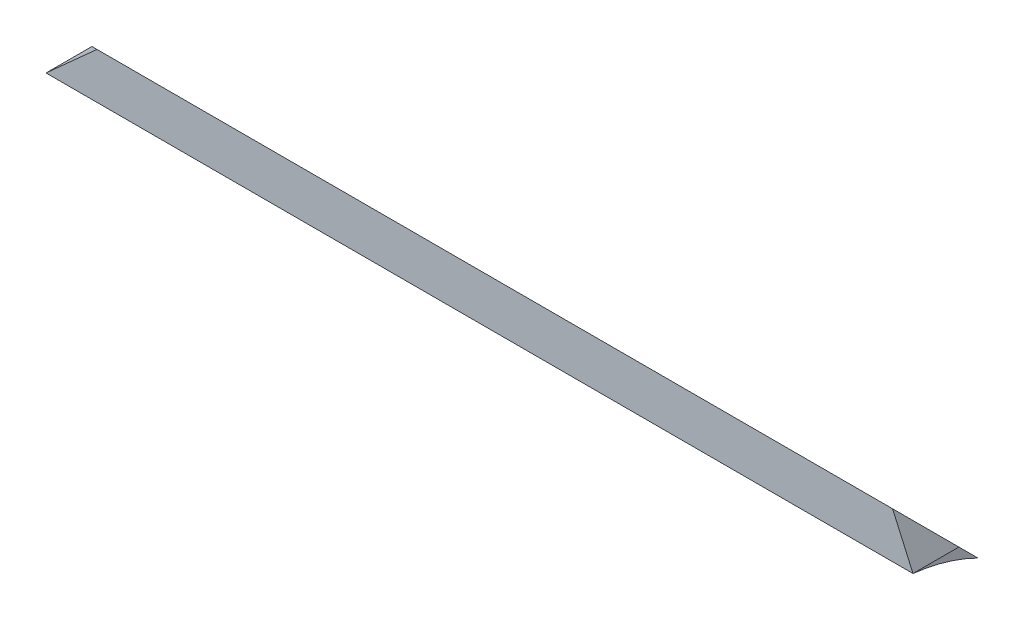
ISO-10303-21;
HEADER;
FILE_DESCRIPTION(('STEP AP214'),'2;1');
FILE_NAME('part.step','',(''),(''),'','','');
FILE_SCHEMA(('AUTOMOTIVE_DESIGN { 1 0 10303 214 1 1 1 1 }'));
ENDSEC;
DATA;
#1=APPLICATION_CONTEXT('core data for automotive mechanical design processes');
#2=APPLICATION_PROTOCOL_DEFINITION('international standard','automotive_design',2000,#1);
#3=PRODUCT_CONTEXT('',#1,'mechanical');
#4=PRODUCT('Part','Part','',(#3));
#5=PRODUCT_RELATED_PRODUCT_CATEGORY('part','',(#4));
#6=PRODUCT_DEFINITION_FORMATION('','',#4);
#7=PRODUCT_DEFINITION_CONTEXT('part definition',#1,'design');
#8=PRODUCT_DEFINITION('design','',#6,#7);
#9=PRODUCT_DEFINITION_SHAPE('','',#8);
#10=(LENGTH_UNIT() NAMED_UNIT(*) SI_UNIT(.MILLI.,.METRE.));
#11=(NAMED_UNIT(*) PLANE_ANGLE_UNIT() SI_UNIT($,.RADIAN.));
#12=(NAMED_UNIT(*) SI_UNIT($,.STERADIAN.) SOLID_ANGLE_UNIT());
#13=UNCERTAINTY_MEASURE_WITH_UNIT(LENGTH_MEASURE(1.E-05),#10,'distance_accuracy_value','');
#14=(GEOMETRIC_REPRESENTATION_CONTEXT(3) GLOBAL_UNCERTAINTY_ASSIGNED_CONTEXT((#13)) GLOBAL_UNIT_ASSIGNED_CONTEXT((#10,
#11,#12)) REPRESENTATION_CONTEXT('',''));
#15=CARTESIAN_POINT('',(0.,0.,0.));
#16=DIRECTION('',(0.,0.,1.));
#17=DIRECTION('',(1.,0.,0.));
#18=AXIS2_PLACEMENT_3D('',#15,#16,#17);
#19=CARTESIAN_POINT('',(0.,12.7,0.));
#20=DIRECTION('',(1.,0.,0.));
#21=DIRECTION('',(0.,0.,-1.));
#22=AXIS2_PLACEMENT_3D('',#19,#20,#21);
#23=PLANE('',#22);
#24=DIRECTION('',(0.,0.,1.));
#25=VECTOR('',#24,1.);
#26=CARTESIAN_POINT('',(0.,2.80039496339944,-12.7));
#27=LINE('',#26,#25);
#28=CARTESIAN_POINT('',(0.,2.80039496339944,-9.89960503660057));
#29=VERTEX_POINT('',#28);
#30=CARTESIAN_POINT('',(0.,2.80039496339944,-3.175));
#31=VERTEX_POINT('',#30);
#32=EDGE_CURVE('E77',#29,#31,#27,.T.);
#33=ORIENTED_EDGE('',*,*,#32,.F.);
#34=DIRECTION('',(0.,-0.707106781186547,-0.707106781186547));
#35=VECTOR('',#34,1.);
#36=CARTESIAN_POINT('',(0.,12.7,0.));
#37=LINE('',#36,#35);
#38=CARTESIAN_POINT('',(0.,0.,-12.7));
#39=VERTEX_POINT('',#38);
#40=EDGE_CURVE('E54',#29,#39,#37,.T.);
#41=ORIENTED_EDGE('',*,*,#40,.T.);
#42=CARTESIAN_POINT('',(0.,-25.5976683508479,0.));
#43=DIRECTION('',(1.,0.,0.));
#44=DIRECTION('',(0.,0.,-1.));
#45=AXIS2_PLACEMENT_3D('',#42,#43,#44);
#46=CIRCLE('',#45,28.575);
#47=EDGE_CURVE('E97',#39,#31,#46,.T.);
#48=ORIENTED_EDGE('',*,*,#47,.T.);
#49=EDGE_LOOP('',(#33,#41,#48));
#50=FACE_BOUND('',#49,.T.);
#51=ADVANCED_FACE('F32',(#50),#23,.F.);
#52=CARTESIAN_POINT('',(127.,12.7,0.));
#53=DIRECTION('',(-1.,0.,0.));
#54=DIRECTION('',(0.,0.,1.));
#55=AXIS2_PLACEMENT_3D('',#52,#53,#54);
#56=PLANE('',#55);
#57=DIRECTION('',(0.,0.,1.));
#58=VECTOR('',#57,1.);
#59=CARTESIAN_POINT('',(127.,2.80039496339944,-12.7));
#60=LINE('',#59,#58);
#61=CARTESIAN_POINT('',(127.,2.80039496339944,-9.89960503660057));
#62=VERTEX_POINT('',#61);
#63=CARTESIAN_POINT('',(127.,2.80039496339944,-3.175));
#64=VERTEX_POINT('',#63);
#65=EDGE_CURVE('E71',#62,#64,#60,.T.);
#66=ORIENTED_EDGE('',*,*,#65,.T.);
#67=CARTESIAN_POINT('',(127.,-25.5976683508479,0.));
#68=DIRECTION('',(1.,0.,0.));
#69=DIRECTION('',(0.,0.,-1.));
#70=AXIS2_PLACEMENT_3D('',#67,#68,#69);
#71=CIRCLE('',#70,28.575);
#72=CARTESIAN_POINT('',(127.,0.,-12.7));
#73=VERTEX_POINT('',#72);
#74=EDGE_CURVE('E91',#73,#64,#71,.T.);
#75=ORIENTED_EDGE('',*,*,#74,.F.);
#76=DIRECTION('',(0.,-0.707106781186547,-0.707106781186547));
#77=VECTOR('',#76,1.);
#78=CARTESIAN_POINT('',(127.,12.7,0.));
#79=LINE('',#78,#77);
#80=EDGE_CURVE('E84',#62,#73,#79,.T.);
#81=ORIENTED_EDGE('',*,*,#80,.F.);
#82=EDGE_LOOP('',(#66,#75,#81));
#83=FACE_BOUND('',#82,.T.);
#84=ADVANCED_FACE('F90',(#83),#56,.F.);
#85=CARTESIAN_POINT('',(0.,12.7,0.));
#86=DIRECTION('',(0.,-0.707106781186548,0.707106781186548));
#87=DIRECTION('',(0.,-0.707106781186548,-0.707106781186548));
#88=AXIS2_PLACEMENT_3D('',#85,#86,#87);
#89=PLANE('',#88);
#90=DIRECTION('',(-0.617802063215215,-0.556021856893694,-0.556021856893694));
#91=VECTOR('',#90,1.);
#92=CARTESIAN_POINT('',(6.80125536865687,8.92152479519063,-3.77847520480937));
#93=LINE('',#92,#91);
#94=CARTESIAN_POINT('',(7.47178337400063,9.525,-3.175));
#95=VERTEX_POINT('',#94);
#96=EDGE_CURVE('E88',#95,#29,#93,.T.);
#97=ORIENTED_EDGE('',*,*,#96,.F.);
#98=DIRECTION('',(1.,0.,0.));
#99=VECTOR('',#98,1.);
#100=CARTESIAN_POINT('',(0.,9.525,-3.175));
#101=LINE('',#100,#99);
#102=CARTESIAN_POINT('',(124.0112866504,9.525,-3.175));
#103=VERTEX_POINT('',#102);
#104=EDGE_CURVE('E87',#95,#103,#101,.T.);
#105=ORIENTED_EDGE('',*,*,#104,.T.);
#106=DIRECTION('',(-0.299812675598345,0.674578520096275,0.674578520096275));
#107=VECTOR('',#106,1.);
#108=CARTESIAN_POINT('',(111.579935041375,37.4955411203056,24.7955411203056));
#109=LINE('',#108,#107);
#110=EDGE_CURVE('E46',#62,#103,#109,.T.);
#111=ORIENTED_EDGE('',*,*,#110,.F.);
#112=ORIENTED_EDGE('',*,*,#80,.T.);
#113=DIRECTION('',(-1.,0.,0.));
#114=VECTOR('',#113,1.);
#115=CARTESIAN_POINT('',(0.,0.,-12.7));
#116=LINE('',#115,#114);
#117=EDGE_CURVE('E94',#73,#39,#116,.T.);
#118=ORIENTED_EDGE('',*,*,#117,.T.);
#119=ORIENTED_EDGE('',*,*,#40,.F.);
#120=EDGE_LOOP('',(#97,#105,#111,#112,#118,#119));
#121=FACE_BOUND('',#120,.T.);
#122=ADVANCED_FACE('F82',(#121),#89,.F.);
#123=CARTESIAN_POINT('',(0.,22.1081044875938,-3.175));
#124=DIRECTION('',(0.,0.,-1.));
#125=DIRECTION('',(0.,1.,0.));
#126=AXIS2_PLACEMENT_3D('',#123,#124,#125);
#127=PLANE('',#126);
#128=DIRECTION('',(0.743294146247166,0.66896473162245,0.));
#129=VECTOR('',#128,1.);
#130=CARTESIAN_POINT('',(9.60051854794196,11.4408616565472,-3.175));
#131=LINE('',#130,#129);
#132=EDGE_CURVE('E12',#31,#95,#131,.T.);
#133=ORIENTED_EDGE('',*,*,#132,.F.);
#134=DIRECTION('',(1.,0.,0.));
#135=VECTOR('',#134,1.);
#136=CARTESIAN_POINT('',(0.,2.80039496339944,-3.175));
#137=LINE('',#136,#135);
#138=EDGE_CURVE('E92',#31,#64,#137,.T.);
#139=ORIENTED_EDGE('',*,*,#138,.T.);
#140=DIRECTION('',(0.406138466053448,-0.913811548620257,0.));
#141=VECTOR('',#140,1.);
#142=CARTESIAN_POINT('',(98.8857985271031,66.0573482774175,-3.175));
#143=LINE('',#142,#141);
#144=EDGE_CURVE('E39',#103,#64,#143,.T.);
#145=ORIENTED_EDGE('',*,*,#144,.F.);
#146=ORIENTED_EDGE('',*,*,#104,.F.);
#147=EDGE_LOOP('',(#133,#139,#145,#146));
#148=FACE_BOUND('',#147,.T.);
#149=ADVANCED_FACE('F112',(#148),#127,.F.);
#150=CARTESIAN_POINT('',(0.,-25.5976683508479,0.));
#151=DIRECTION('',(1.,0.,0.));
#152=DIRECTION('',(0.,0.,-1.));
#153=AXIS2_PLACEMENT_3D('',#150,#151,#152);
#154=CYLINDRICAL_SURFACE('',#153,28.575);
#155=ORIENTED_EDGE('',*,*,#74,.T.);
#156=ORIENTED_EDGE('',*,*,#138,.F.);
#157=ORIENTED_EDGE('',*,*,#47,.F.);
#158=ORIENTED_EDGE('',*,*,#117,.F.);
#159=EDGE_LOOP('',(#155,#156,#157,#158));
#160=FACE_BOUND('',#159,.T.);
#161=ADVANCED_FACE('F103',(#160),#154,.F.);
#162=CARTESIAN_POINT('',(127.,2.80039496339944,-12.7));
#163=DIRECTION('',(0.913811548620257,0.406138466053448,0.));
#164=DIRECTION('',(-0.406138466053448,0.913811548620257,0.));
#165=AXIS2_PLACEMENT_3D('',#162,#163,#164);
#166=PLANE('',#165);
#167=ORIENTED_EDGE('',*,*,#110,.T.);
#168=ORIENTED_EDGE('',*,*,#144,.T.);
#169=ORIENTED_EDGE('',*,*,#65,.F.);
#170=EDGE_LOOP('',(#167,#168,#169));
#171=FACE_BOUND('',#170,.T.);
#172=ADVANCED_FACE('F72',(#171),#166,.T.);
#173=CARTESIAN_POINT('',(63.5,59.9503949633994,-12.7));
#174=DIRECTION('',(-0.66896473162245,0.743294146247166,0.));
#175=DIRECTION('',(-0.743294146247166,-0.66896473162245,0.));
#176=AXIS2_PLACEMENT_3D('',#173,#174,#175);
#177=PLANE('',#176);
#178=ORIENTED_EDGE('',*,*,#96,.T.);
#179=ORIENTED_EDGE('',*,*,#32,.T.);
#180=ORIENTED_EDGE('',*,*,#132,.T.);
#181=EDGE_LOOP('',(#178,#179,#180));
#182=FACE_BOUND('',#181,.T.);
#183=ADVANCED_FACE('F110',(#182),#177,.T.);
#184=CLOSED_SHELL('',(#51,#84,#122,#149,#161,#172,#183));
#185=MANIFOLD_SOLID_BREP('B2',#184);
#186=ADVANCED_BREP_SHAPE_REPRESENTATION('',(#18,#185),#14);
#187=SHAPE_DEFINITION_REPRESENTATION(#9,#186);
ENDSEC;
END-ISO-10303-21;
